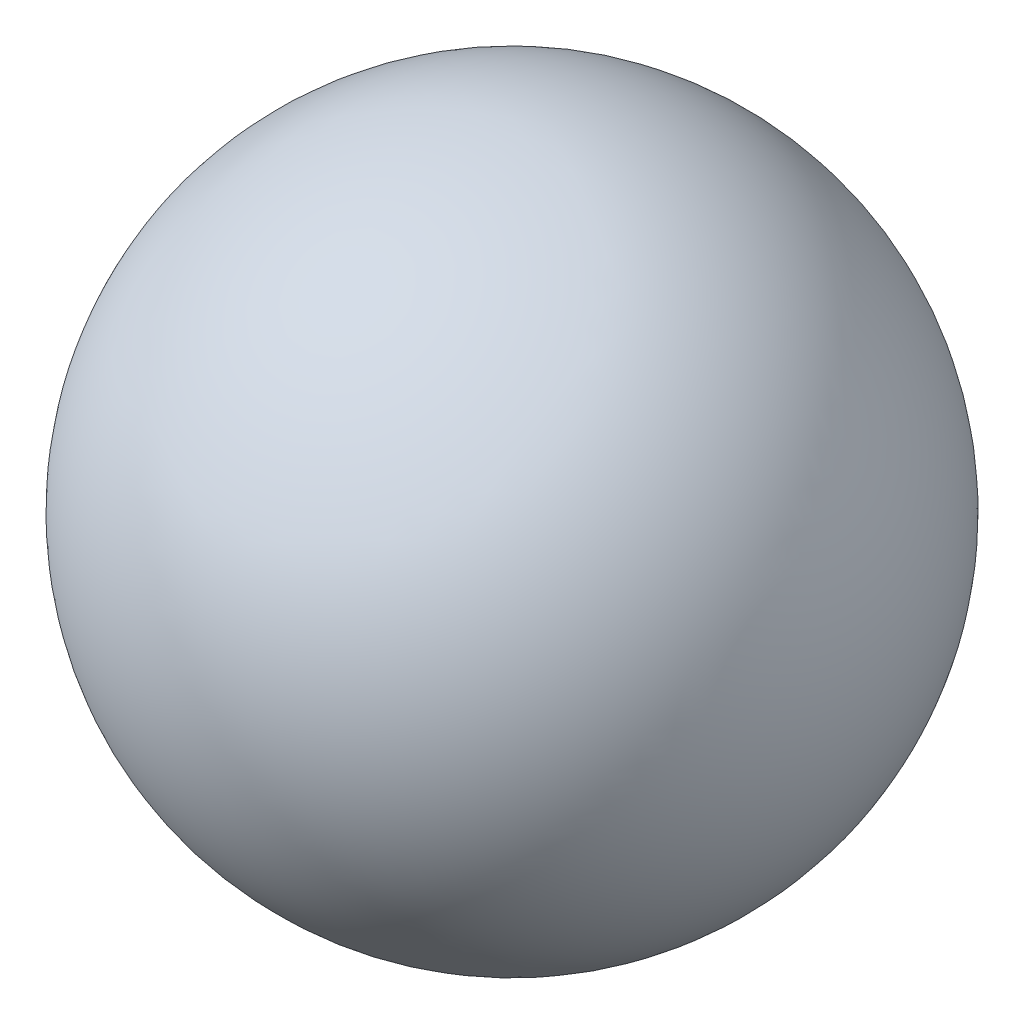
from build123d import *


with BuildPart() as part:
    # Esquisse1 → Base-R_volution (revolve)
    with BuildSketch(Plane(origin=(0, 0, 0), x_dir=(1, 0, 0), z_dir=(0, 1, 0))):
        with BuildLine():
            Line((2.1, 4.9), (8.7, 4.9))
            ThreePointArc((8.7, 4.9), (5.4, 8.2), (2.1, 4.9))
        make_face()
    revolve(axis=Axis((-0.6, 0, -4.9), (1, 0, 0)))


solid = part.part
